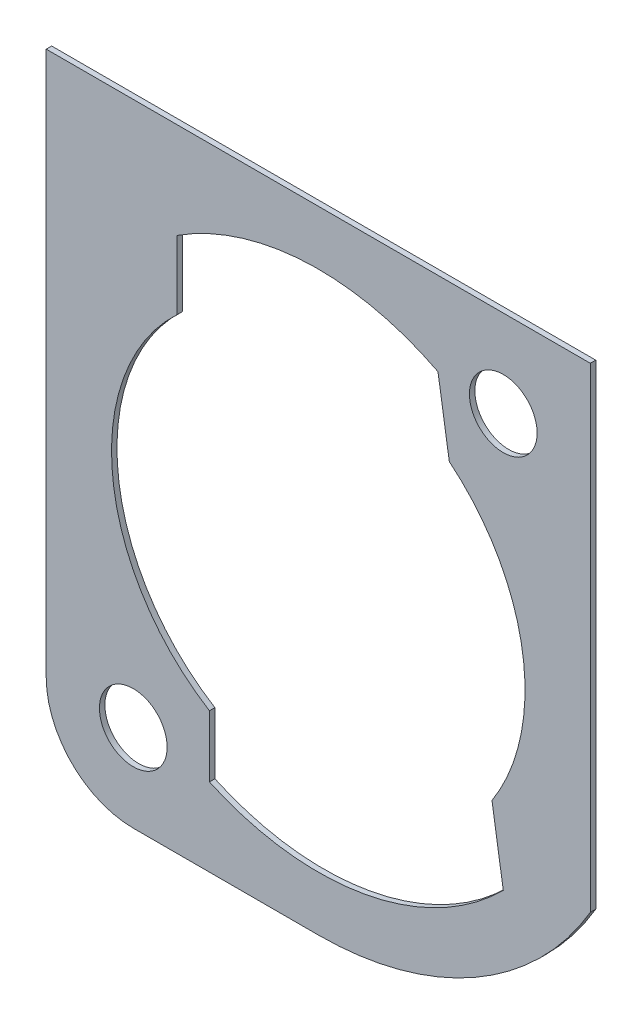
ISO-10303-21;
HEADER;
FILE_DESCRIPTION(('STEP AP214'),'2;1');
FILE_NAME('part.step','',(''),(''),'','','');
FILE_SCHEMA(('AUTOMOTIVE_DESIGN { 1 0 10303 214 1 1 1 1 }'));
ENDSEC;
DATA;
#1=APPLICATION_CONTEXT('core data for automotive mechanical design processes');
#2=APPLICATION_PROTOCOL_DEFINITION('international standard','automotive_design',2000,#1);
#3=PRODUCT_CONTEXT('',#1,'mechanical');
#4=PRODUCT('Part','Part','',(#3));
#5=PRODUCT_RELATED_PRODUCT_CATEGORY('part','',(#4));
#6=PRODUCT_DEFINITION_FORMATION('','',#4);
#7=PRODUCT_DEFINITION_CONTEXT('part definition',#1,'design');
#8=PRODUCT_DEFINITION('design','',#6,#7);
#9=PRODUCT_DEFINITION_SHAPE('','',#8);
#10=(LENGTH_UNIT() NAMED_UNIT(*) SI_UNIT(.MILLI.,.METRE.));
#11=(NAMED_UNIT(*) PLANE_ANGLE_UNIT() SI_UNIT($,.RADIAN.));
#12=(NAMED_UNIT(*) SI_UNIT($,.STERADIAN.) SOLID_ANGLE_UNIT());
#13=UNCERTAINTY_MEASURE_WITH_UNIT(LENGTH_MEASURE(1.E-05),#10,'distance_accuracy_value','');
#14=(GEOMETRIC_REPRESENTATION_CONTEXT(3) GLOBAL_UNCERTAINTY_ASSIGNED_CONTEXT((#13)) GLOBAL_UNIT_ASSIGNED_CONTEXT((#10,
#11,#12)) REPRESENTATION_CONTEXT('',''));
#15=CARTESIAN_POINT('',(0.,0.,0.));
#16=DIRECTION('',(0.,0.,1.));
#17=DIRECTION('',(1.,0.,0.));
#18=AXIS2_PLACEMENT_3D('',#15,#16,#17);
#19=CARTESIAN_POINT('',(0.,0.,-0.25));
#20=DIRECTION('',(0.,0.,1.));
#21=DIRECTION('',(1.,0.,0.));
#22=AXIS2_PLACEMENT_3D('',#19,#20,#21);
#23=PLANE('',#22);
#24=DIRECTION('',(0.,1.,0.));
#25=VECTOR('',#24,1.);
#26=CARTESIAN_POINT('',(-13.,13.85640646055,-0.25));
#27=LINE('',#26,#25);
#28=CARTESIAN_POINT('',(-13.,13.8564064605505,-0.25));
#29=VERTEX_POINT('',#28);
#30=CARTESIAN_POINT('',(-13.0000000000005,20.1742410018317,-0.25));
#31=VERTEX_POINT('',#30);
#32=EDGE_CURVE('E163',#29,#31,#27,.T.);
#33=ORIENTED_EDGE('',*,*,#32,.F.);
#34=CARTESIAN_POINT('',(0.,0.,-0.25));
#35=DIRECTION('',(0.,0.,1.));
#36=DIRECTION('',(1.,0.,0.));
#37=AXIS2_PLACEMENT_3D('',#34,#35,#36);
#38=CIRCLE('',#37,19.);
#39=CARTESIAN_POINT('',(-10.0000000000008,-16.155494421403,-0.25));
#40=VERTEX_POINT('',#39);
#41=EDGE_CURVE('E170',#29,#40,#38,.T.);
#42=ORIENTED_EDGE('',*,*,#41,.T.);
#43=DIRECTION('',(0.,1.,0.));
#44=VECTOR('',#43,1.);
#45=CARTESIAN_POINT('',(-10.,-21.81742422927,-0.25));
#46=LINE('',#45,#44);
#47=CARTESIAN_POINT('',(-10.,-21.8174242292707,-0.25));
#48=VERTEX_POINT('',#47);
#49=EDGE_CURVE('E167',#48,#40,#46,.T.);
#50=ORIENTED_EDGE('',*,*,#49,.F.);
#51=CARTESIAN_POINT('',(0.,0.,-0.25));
#52=DIRECTION('',(0.,0.,1.));
#53=DIRECTION('',(1.,0.,0.));
#54=AXIS2_PLACEMENT_3D('',#51,#52,#53);
#55=CIRCLE('',#54,24.);
#56=CARTESIAN_POINT('',(16.9999999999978,-16.9410743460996,-0.25));
#57=VERTEX_POINT('',#56);
#58=EDGE_CURVE('E175',#48,#57,#55,.T.);
#59=ORIENTED_EDGE('',*,*,#58,.T.);
#60=DIRECTION('',(0.154881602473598,-0.987933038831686,0.));
#61=VECTOR('',#60,1.);
#62=CARTESIAN_POINT('',(15.96023294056,-10.30878094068,-0.25));
#63=LINE('',#62,#61);
#64=CARTESIAN_POINT('',(15.9602329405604,-10.3087809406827,-0.25));
#65=VERTEX_POINT('',#64);
#66=EDGE_CURVE('E172',#65,#57,#63,.T.);
#67=ORIENTED_EDGE('',*,*,#66,.F.);
#68=CARTESIAN_POINT('',(0.,0.,-0.25));
#69=DIRECTION('',(0.,0.,1.));
#70=DIRECTION('',(1.,0.,0.));
#71=AXIS2_PLACEMENT_3D('',#68,#69,#70);
#72=CIRCLE('',#71,19.);
#73=CARTESIAN_POINT('',(12.0397670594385,14.698435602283,-0.25));
#74=VERTEX_POINT('',#73);
#75=EDGE_CURVE('E161',#65,#74,#72,.T.);
#76=ORIENTED_EDGE('',*,*,#75,.T.);
#77=DIRECTION('',(0.154881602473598,-0.987933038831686,0.));
#78=VECTOR('',#77,1.);
#79=CARTESIAN_POINT('',(11.,21.3307290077,-0.25));
#80=LINE('',#79,#78);
#81=CARTESIAN_POINT('',(11.0000000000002,21.3307290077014,-0.25));
#82=VERTEX_POINT('',#81);
#83=EDGE_CURVE('E158',#82,#74,#80,.T.);
#84=ORIENTED_EDGE('',*,*,#83,.F.);
#85=CARTESIAN_POINT('',(0.,0.,-0.25));
#86=DIRECTION('',(0.,0.,1.));
#87=DIRECTION('',(1.,0.,0.));
#88=AXIS2_PLACEMENT_3D('',#85,#86,#87);
#89=CIRCLE('',#88,24.);
#90=EDGE_CURVE('E165',#82,#31,#89,.T.);
#91=ORIENTED_EDGE('',*,*,#90,.T.);
#92=EDGE_LOOP('',(#33,#42,#50,#59,#67,#76,#84,#91));
#93=FACE_BOUND('',#92,.T.);
#94=CARTESIAN_POINT('',(-17.,-21.,-0.25));
#95=DIRECTION('',(0.,0.,1.));
#96=DIRECTION('',(1.,0.,0.));
#97=AXIS2_PLACEMENT_3D('',#94,#95,#96);
#98=CIRCLE('',#97,3.112298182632);
#99=CARTESIAN_POINT('',(-13.887701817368,-21.,-0.25));
#100=VERTEX_POINT('',#99);
#101=EDGE_CURVE('E162',#100,#100,#98,.T.);
#102=ORIENTED_EDGE('',*,*,#101,.T.);
#103=EDGE_LOOP('',(#102));
#104=FACE_BOUND('',#103,.T.);
#105=CARTESIAN_POINT('',(17.,21.,-0.25));
#106=DIRECTION('',(0.,0.,1.));
#107=DIRECTION('',(1.,0.,0.));
#108=AXIS2_PLACEMENT_3D('',#105,#106,#107);
#109=CIRCLE('',#108,3.112298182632);
#110=CARTESIAN_POINT('',(20.112298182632,21.,-0.25));
#111=VERTEX_POINT('',#110);
#112=EDGE_CURVE('E219',#111,#111,#109,.T.);
#113=ORIENTED_EDGE('',*,*,#112,.T.);
#114=EDGE_LOOP('',(#113));
#115=FACE_BOUND('',#114,.T.);
#116=CARTESIAN_POINT('',(-17.,-21.,-0.25));
#117=DIRECTION('',(0.,0.,1.));
#118=DIRECTION('',(1.,0.,0.));
#119=AXIS2_PLACEMENT_3D('',#116,#117,#118);
#120=CIRCLE('',#119,8.);
#121=CARTESIAN_POINT('',(-25.,-21.,-0.25));
#122=VERTEX_POINT('',#121);
#123=CARTESIAN_POINT('',(-17.,-29.,-0.25));
#124=VERTEX_POINT('',#123);
#125=EDGE_CURVE('E20',#122,#124,#120,.T.);
#126=ORIENTED_EDGE('',*,*,#125,.F.);
#127=DIRECTION('',(0.,1.,0.));
#128=VECTOR('',#127,1.);
#129=CARTESIAN_POINT('',(-25.,29.,-0.25));
#130=LINE('',#129,#128);
#131=CARTESIAN_POINT('',(-25.,29.,-0.25));
#132=VERTEX_POINT('',#131);
#133=EDGE_CURVE('E110',#132,#122,#130,.F.);
#134=ORIENTED_EDGE('',*,*,#133,.F.);
#135=DIRECTION('',(1.,0.,0.));
#136=VECTOR('',#135,1.);
#137=CARTESIAN_POINT('',(25.,29.,-0.25));
#138=LINE('',#137,#136);
#139=CARTESIAN_POINT('',(25.,29.,-0.25));
#140=VERTEX_POINT('',#139);
#141=EDGE_CURVE('E119',#140,#132,#138,.F.);
#142=ORIENTED_EDGE('',*,*,#141,.F.);
#143=DIRECTION('',(0.,1.,0.));
#144=VECTOR('',#143,1.);
#145=CARTESIAN_POINT('',(25.,-14.6969384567,-0.25));
#146=LINE('',#145,#144);
#147=CARTESIAN_POINT('',(24.9999999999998,-14.6969384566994,-0.25));
#148=VERTEX_POINT('',#147);
#149=EDGE_CURVE('E155',#148,#140,#146,.T.);
#150=ORIENTED_EDGE('',*,*,#149,.F.);
#151=CARTESIAN_POINT('',(0.,0.,-0.25));
#152=DIRECTION('',(0.,0.,1.));
#153=DIRECTION('',(1.,0.,0.));
#154=AXIS2_PLACEMENT_3D('',#151,#152,#153);
#155=CIRCLE('',#154,29.);
#156=CARTESIAN_POINT('',(0.,-29.,-0.25));
#157=VERTEX_POINT('',#156);
#158=EDGE_CURVE('E221',#157,#148,#155,.T.);
#159=ORIENTED_EDGE('',*,*,#158,.F.);
#160=DIRECTION('',(1.,0.,0.));
#161=VECTOR('',#160,1.);
#162=CARTESIAN_POINT('',(-17.,-29.,-0.25));
#163=LINE('',#162,#161);
#164=EDGE_CURVE('E177',#124,#157,#163,.T.);
#165=ORIENTED_EDGE('',*,*,#164,.F.);
#166=EDGE_LOOP('',(#126,#134,#142,#150,#159,#165));
#167=FACE_BOUND('',#166,.T.);
#168=ADVANCED_FACE('F16',(#93,#104,#115,#167),#23,.F.);
#169=CARTESIAN_POINT('',(25.,-14.6969384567,-0.25));
#170=DIRECTION('',(1.,0.,0.));
#171=DIRECTION('',(0.,0.,-1.));
#172=AXIS2_PLACEMENT_3D('',#169,#170,#171);
#173=PLANE('',#172);
#174=DIRECTION('',(0.,0.,1.));
#175=VECTOR('',#174,1.);
#176=CARTESIAN_POINT('',(24.9999999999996,-14.6969384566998,-0.25));
#177=LINE('',#176,#175);
#178=CARTESIAN_POINT('',(24.9999999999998,-14.6969384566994,0.25));
#179=VERTEX_POINT('',#178);
#180=EDGE_CURVE('E179',#148,#179,#177,.T.);
#181=ORIENTED_EDGE('',*,*,#180,.F.);
#182=ORIENTED_EDGE('',*,*,#149,.T.);
#183=DIRECTION('',(0.,0.,1.));
#184=VECTOR('',#183,1.);
#185=CARTESIAN_POINT('',(25.,29.,-0.25));
#186=LINE('',#185,#184);
#187=CARTESIAN_POINT('',(25.,29.,0.25));
#188=VERTEX_POINT('',#187);
#189=EDGE_CURVE('E124',#188,#140,#186,.F.);
#190=ORIENTED_EDGE('',*,*,#189,.F.);
#191=DIRECTION('',(0.,1.,0.));
#192=VECTOR('',#191,1.);
#193=CARTESIAN_POINT('',(25.,0.,0.25));
#194=LINE('',#193,#192);
#195=EDGE_CURVE('E145',#179,#188,#194,.T.);
#196=ORIENTED_EDGE('',*,*,#195,.F.);
#197=EDGE_LOOP('',(#181,#182,#190,#196));
#198=FACE_BOUND('',#197,.T.);
#199=ADVANCED_FACE('F404',(#198),#173,.T.);
#200=CARTESIAN_POINT('',(25.,29.,-0.25));
#201=DIRECTION('',(0.,1.,0.));
#202=DIRECTION('',(0.,0.,1.));
#203=AXIS2_PLACEMENT_3D('',#200,#201,#202);
#204=PLANE('',#203);
#205=ORIENTED_EDGE('',*,*,#189,.T.);
#206=ORIENTED_EDGE('',*,*,#141,.T.);
#207=DIRECTION('',(0.,0.,1.));
#208=VECTOR('',#207,1.);
#209=CARTESIAN_POINT('',(-25.,29.,-0.25));
#210=LINE('',#209,#208);
#211=CARTESIAN_POINT('',(-25.,29.,0.25));
#212=VERTEX_POINT('',#211);
#213=EDGE_CURVE('E126',#212,#132,#210,.F.);
#214=ORIENTED_EDGE('',*,*,#213,.F.);
#215=DIRECTION('',(1.,0.,0.));
#216=VECTOR('',#215,1.);
#217=CARTESIAN_POINT('',(0.,29.,0.25));
#218=LINE('',#217,#216);
#219=EDGE_CURVE('E130',#188,#212,#218,.F.);
#220=ORIENTED_EDGE('',*,*,#219,.F.);
#221=EDGE_LOOP('',(#205,#206,#214,#220));
#222=FACE_BOUND('',#221,.T.);
#223=ADVANCED_FACE('F128',(#222),#204,.T.);
#224=CARTESIAN_POINT('',(-25.,29.,-0.25));
#225=DIRECTION('',(-1.,0.,0.));
#226=DIRECTION('',(0.,0.,1.));
#227=AXIS2_PLACEMENT_3D('',#224,#225,#226);
#228=PLANE('',#227);
#229=ORIENTED_EDGE('',*,*,#213,.T.);
#230=ORIENTED_EDGE('',*,*,#133,.T.);
#231=DIRECTION('',(0.,0.,1.));
#232=VECTOR('',#231,1.);
#233=CARTESIAN_POINT('',(-25.,-21.,-0.25));
#234=LINE('',#233,#232);
#235=CARTESIAN_POINT('',(-25.,-21.,0.25));
#236=VERTEX_POINT('',#235);
#237=EDGE_CURVE('E137',#236,#122,#234,.F.);
#238=ORIENTED_EDGE('',*,*,#237,.F.);
#239=DIRECTION('',(0.,1.,0.));
#240=VECTOR('',#239,1.);
#241=CARTESIAN_POINT('',(-25.,0.,0.25));
#242=LINE('',#241,#240);
#243=EDGE_CURVE('E134',#212,#236,#242,.F.);
#244=ORIENTED_EDGE('',*,*,#243,.F.);
#245=EDGE_LOOP('',(#229,#230,#238,#244));
#246=FACE_BOUND('',#245,.T.);
#247=ADVANCED_FACE('F135',(#246),#228,.T.);
#248=CARTESIAN_POINT('',(-17.,-21.,-0.25));
#249=DIRECTION('',(0.,0.,1.));
#250=DIRECTION('',(1.,0.,0.));
#251=AXIS2_PLACEMENT_3D('',#248,#249,#250);
#252=CYLINDRICAL_SURFACE('',#251,8.);
#253=ORIENTED_EDGE('',*,*,#237,.T.);
#254=ORIENTED_EDGE('',*,*,#125,.T.);
#255=DIRECTION('',(0.,0.,-1.));
#256=VECTOR('',#255,1.);
#257=CARTESIAN_POINT('',(-17.,-29.,-0.25));
#258=LINE('',#257,#256);
#259=CARTESIAN_POINT('',(-17.,-29.,0.25));
#260=VERTEX_POINT('',#259);
#261=EDGE_CURVE('E180',#260,#124,#258,.T.);
#262=ORIENTED_EDGE('',*,*,#261,.F.);
#263=CARTESIAN_POINT('',(-17.,-21.,0.25));
#264=DIRECTION('',(0.,0.,1.));
#265=DIRECTION('',(1.,0.,0.));
#266=AXIS2_PLACEMENT_3D('',#263,#264,#265);
#267=CIRCLE('',#266,8.);
#268=EDGE_CURVE('E141',#236,#260,#267,.T.);
#269=ORIENTED_EDGE('',*,*,#268,.F.);
#270=EDGE_LOOP('',(#253,#254,#262,#269));
#271=FACE_BOUND('',#270,.T.);
#272=ADVANCED_FACE('F237',(#271),#252,.T.);
#273=CARTESIAN_POINT('',(-17.,-29.,-0.25));
#274=DIRECTION('',(0.,-1.,0.));
#275=DIRECTION('',(0.,0.,-1.));
#276=AXIS2_PLACEMENT_3D('',#273,#274,#275);
#277=PLANE('',#276);
#278=ORIENTED_EDGE('',*,*,#261,.T.);
#279=ORIENTED_EDGE('',*,*,#164,.T.);
#280=DIRECTION('',(0.,0.,1.));
#281=VECTOR('',#280,1.);
#282=CARTESIAN_POINT('',(0.,-29.,-0.25));
#283=LINE('',#282,#281);
#284=CARTESIAN_POINT('',(0.,-29.,0.25));
#285=VERTEX_POINT('',#284);
#286=EDGE_CURVE('E223',#285,#157,#283,.F.);
#287=ORIENTED_EDGE('',*,*,#286,.F.);
#288=DIRECTION('',(1.,0.,0.));
#289=VECTOR('',#288,1.);
#290=CARTESIAN_POINT('',(0.,-29.,0.25));
#291=LINE('',#290,#289);
#292=EDGE_CURVE('E208',#260,#285,#291,.T.);
#293=ORIENTED_EDGE('',*,*,#292,.F.);
#294=EDGE_LOOP('',(#278,#279,#287,#293));
#295=FACE_BOUND('',#294,.T.);
#296=ADVANCED_FACE('F241',(#295),#277,.T.);
#297=CARTESIAN_POINT('',(0.,0.,-0.25));
#298=DIRECTION('',(0.,0.,1.));
#299=DIRECTION('',(1.,0.,0.));
#300=AXIS2_PLACEMENT_3D('',#297,#298,#299);
#301=CYLINDRICAL_SURFACE('',#300,29.);
#302=ORIENTED_EDGE('',*,*,#286,.T.);
#303=ORIENTED_EDGE('',*,*,#158,.T.);
#304=ORIENTED_EDGE('',*,*,#180,.T.);
#305=CARTESIAN_POINT('',(0.,0.,0.25));
#306=DIRECTION('',(0.,0.,1.));
#307=DIRECTION('',(1.,0.,0.));
#308=AXIS2_PLACEMENT_3D('',#305,#306,#307);
#309=CIRCLE('',#308,29.);
#310=EDGE_CURVE('E206',#285,#179,#309,.T.);
#311=ORIENTED_EDGE('',*,*,#310,.F.);
#312=EDGE_LOOP('',(#302,#303,#304,#311));
#313=FACE_BOUND('',#312,.T.);
#314=ADVANCED_FACE('F372',(#313),#301,.T.);
#315=CARTESIAN_POINT('',(17.,21.,-0.25));
#316=DIRECTION('',(0.,0.,1.));
#317=DIRECTION('',(1.,0.,0.));
#318=AXIS2_PLACEMENT_3D('',#315,#316,#317);
#319=CYLINDRICAL_SURFACE('',#318,3.112298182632);
#320=CARTESIAN_POINT('',(17.,21.,0.25));
#321=DIRECTION('',(0.,0.,1.));
#322=DIRECTION('',(1.,0.,0.));
#323=AXIS2_PLACEMENT_3D('',#320,#321,#322);
#324=CIRCLE('',#323,3.112298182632);
#325=CARTESIAN_POINT('',(20.112298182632,21.,0.25));
#326=VERTEX_POINT('',#325);
#327=EDGE_CURVE('E203',#326,#326,#324,.F.);
#328=ORIENTED_EDGE('',*,*,#327,.F.);
#329=EDGE_LOOP('',(#328));
#330=FACE_BOUND('',#329,.T.);
#331=ORIENTED_EDGE('',*,*,#112,.F.);
#332=EDGE_LOOP('',(#331));
#333=FACE_BOUND('',#332,.T.);
#334=ADVANCED_FACE('F364',(#330,#333),#319,.F.);
#335=CARTESIAN_POINT('',(-17.,-21.,-0.25));
#336=DIRECTION('',(0.,0.,1.));
#337=DIRECTION('',(1.,0.,0.));
#338=AXIS2_PLACEMENT_3D('',#335,#336,#337);
#339=CYLINDRICAL_SURFACE('',#338,3.112298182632);
#340=CARTESIAN_POINT('',(-17.,-21.,0.25));
#341=DIRECTION('',(0.,0.,1.));
#342=DIRECTION('',(1.,0.,0.));
#343=AXIS2_PLACEMENT_3D('',#340,#341,#342);
#344=CIRCLE('',#343,3.112298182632);
#345=CARTESIAN_POINT('',(-13.887701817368,-21.,0.25));
#346=VERTEX_POINT('',#345);
#347=EDGE_CURVE('E200',#346,#346,#344,.F.);
#348=ORIENTED_EDGE('',*,*,#347,.F.);
#349=EDGE_LOOP('',(#348));
#350=FACE_BOUND('',#349,.T.);
#351=ORIENTED_EDGE('',*,*,#101,.F.);
#352=EDGE_LOOP('',(#351));
#353=FACE_BOUND('',#352,.T.);
#354=ADVANCED_FACE('F357',(#350,#353),#339,.F.);
#355=CARTESIAN_POINT('',(11.,21.3307290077,-0.25));
#356=DIRECTION('',(-0.987933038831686,-0.154881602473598,0.));
#357=DIRECTION('',(0.154881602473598,-0.987933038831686,0.));
#358=AXIS2_PLACEMENT_3D('',#355,#356,#357);
#359=PLANE('',#358);
#360=DIRECTION('',(0.,0.,1.));
#361=VECTOR('',#360,1.);
#362=CARTESIAN_POINT('',(11.0000000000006,21.3307290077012,-0.25));
#363=LINE('',#362,#361);
#364=CARTESIAN_POINT('',(11.0000000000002,21.3307290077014,0.25));
#365=VERTEX_POINT('',#364);
#366=EDGE_CURVE('E147',#365,#82,#363,.F.);
#367=ORIENTED_EDGE('',*,*,#366,.T.);
#368=ORIENTED_EDGE('',*,*,#83,.T.);
#369=DIRECTION('',(0.,0.,1.));
#370=VECTOR('',#369,1.);
#371=CARTESIAN_POINT('',(12.0397670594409,14.698435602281,-0.25));
#372=LINE('',#371,#370);
#373=CARTESIAN_POINT('',(12.0397670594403,14.6984356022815,0.25));
#374=VERTEX_POINT('',#373);
#375=EDGE_CURVE('E216',#74,#374,#372,.T.);
#376=ORIENTED_EDGE('',*,*,#375,.T.);
#377=DIRECTION('',(0.154881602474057,-0.987933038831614,0.));
#378=VECTOR('',#377,1.);
#379=CARTESIAN_POINT('',(11.,21.3307290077,0.25));
#380=LINE('',#379,#378);
#381=EDGE_CURVE('E199',#365,#374,#380,.T.);
#382=ORIENTED_EDGE('',*,*,#381,.F.);
#383=EDGE_LOOP('',(#367,#368,#376,#382));
#384=FACE_BOUND('',#383,.T.);
#385=ADVANCED_FACE('F263',(#384),#359,.T.);
#386=CARTESIAN_POINT('',(0.,0.,-0.25));
#387=DIRECTION('',(0.,0.,1.));
#388=DIRECTION('',(1.,0.,0.));
#389=AXIS2_PLACEMENT_3D('',#386,#387,#388);
#390=CYLINDRICAL_SURFACE('',#389,19.);
#391=DIRECTION('',(0.,0.,1.));
#392=VECTOR('',#391,1.);
#393=CARTESIAN_POINT('',(15.96023294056,-10.30878094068,-0.25));
#394=LINE('',#393,#392);
#395=CARTESIAN_POINT('',(15.9602329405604,-10.3087809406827,0.25));
#396=VERTEX_POINT('',#395);
#397=EDGE_CURVE('E176',#396,#65,#394,.F.);
#398=ORIENTED_EDGE('',*,*,#397,.F.);
#399=CARTESIAN_POINT('',(0.,0.,0.25));
#400=DIRECTION('',(0.,0.,1.));
#401=DIRECTION('',(1.,0.,0.));
#402=AXIS2_PLACEMENT_3D('',#399,#400,#401);
#403=CIRCLE('',#402,19.);
#404=EDGE_CURVE('E197',#374,#396,#403,.F.);
#405=ORIENTED_EDGE('',*,*,#404,.F.);
#406=ORIENTED_EDGE('',*,*,#375,.F.);
#407=ORIENTED_EDGE('',*,*,#75,.F.);
#408=EDGE_LOOP('',(#398,#405,#406,#407));
#409=FACE_BOUND('',#408,.T.);
#410=ADVANCED_FACE('F268',(#409),#390,.F.);
#411=CARTESIAN_POINT('',(15.96023294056,-10.30878094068,-0.25));
#412=DIRECTION('',(-0.987933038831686,-0.154881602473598,0.));
#413=DIRECTION('',(0.154881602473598,-0.987933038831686,0.));
#414=AXIS2_PLACEMENT_3D('',#411,#412,#413);
#415=PLANE('',#414);
#416=ORIENTED_EDGE('',*,*,#397,.T.);
#417=ORIENTED_EDGE('',*,*,#66,.T.);
#418=DIRECTION('',(0.,0.,1.));
#419=VECTOR('',#418,1.);
#420=CARTESIAN_POINT('',(16.9999999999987,-16.9410743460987,-0.25));
#421=LINE('',#420,#419);
#422=CARTESIAN_POINT('',(16.9999999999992,-16.9410743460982,0.25));
#423=VERTEX_POINT('',#422);
#424=EDGE_CURVE('E214',#57,#423,#421,.T.);
#425=ORIENTED_EDGE('',*,*,#424,.T.);
#426=DIRECTION('',(0.154881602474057,-0.987933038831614,0.));
#427=VECTOR('',#426,1.);
#428=CARTESIAN_POINT('',(15.96023294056,-10.30878094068,0.25));
#429=LINE('',#428,#427);
#430=EDGE_CURVE('E196',#396,#423,#429,.T.);
#431=ORIENTED_EDGE('',*,*,#430,.F.);
#432=EDGE_LOOP('',(#416,#417,#425,#431));
#433=FACE_BOUND('',#432,.T.);
#434=ADVANCED_FACE('F297',(#433),#415,.T.);
#435=CARTESIAN_POINT('',(0.,0.,-0.25));
#436=DIRECTION('',(0.,0.,1.));
#437=DIRECTION('',(1.,0.,0.));
#438=AXIS2_PLACEMENT_3D('',#435,#436,#437);
#439=CYLINDRICAL_SURFACE('',#438,24.);
#440=CARTESIAN_POINT('',(0.,0.,0.25));
#441=DIRECTION('',(0.,0.,1.));
#442=DIRECTION('',(1.,0.,0.));
#443=AXIS2_PLACEMENT_3D('',#440,#441,#442);
#444=CIRCLE('',#443,24.);
#445=CARTESIAN_POINT('',(-10.,-21.8174242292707,0.25));
#446=VERTEX_POINT('',#445);
#447=EDGE_CURVE('E193',#423,#446,#444,.F.);
#448=ORIENTED_EDGE('',*,*,#447,.F.);
#449=ORIENTED_EDGE('',*,*,#424,.F.);
#450=ORIENTED_EDGE('',*,*,#58,.F.);
#451=DIRECTION('',(0.,0.,-1.));
#452=VECTOR('',#451,1.);
#453=CARTESIAN_POINT('',(-10.,-21.81742422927,-0.25));
#454=LINE('',#453,#452);
#455=EDGE_CURVE('E171',#446,#48,#454,.T.);
#456=ORIENTED_EDGE('',*,*,#455,.F.);
#457=EDGE_LOOP('',(#448,#449,#450,#456));
#458=FACE_BOUND('',#457,.T.);
#459=ADVANCED_FACE('F293',(#458),#439,.F.);
#460=CARTESIAN_POINT('',(-10.,-21.81742422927,-0.25));
#461=DIRECTION('',(1.,0.,0.));
#462=DIRECTION('',(0.,0.,-1.));
#463=AXIS2_PLACEMENT_3D('',#460,#461,#462);
#464=PLANE('',#463);
#465=ORIENTED_EDGE('',*,*,#455,.T.);
#466=ORIENTED_EDGE('',*,*,#49,.T.);
#467=DIRECTION('',(0.,0.,1.));
#468=VECTOR('',#467,1.);
#469=CARTESIAN_POINT('',(-10.0000000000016,-16.1554944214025,-0.25));
#470=LINE('',#469,#468);
#471=CARTESIAN_POINT('',(-10.0000000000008,-16.155494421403,0.25));
#472=VERTEX_POINT('',#471);
#473=EDGE_CURVE('E212',#40,#472,#470,.T.);
#474=ORIENTED_EDGE('',*,*,#473,.T.);
#475=DIRECTION('',(0.,1.,0.));
#476=VECTOR('',#475,1.);
#477=CARTESIAN_POINT('',(-10.,0.,0.25));
#478=LINE('',#477,#476);
#479=EDGE_CURVE('E192',#446,#472,#478,.T.);
#480=ORIENTED_EDGE('',*,*,#479,.F.);
#481=EDGE_LOOP('',(#465,#466,#474,#480));
#482=FACE_BOUND('',#481,.T.);
#483=ADVANCED_FACE('F289',(#482),#464,.T.);
#484=CARTESIAN_POINT('',(0.,0.,-0.25));
#485=DIRECTION('',(0.,0.,1.));
#486=DIRECTION('',(1.,0.,0.));
#487=AXIS2_PLACEMENT_3D('',#484,#485,#486);
#488=CYLINDRICAL_SURFACE('',#487,19.);
#489=DIRECTION('',(0.,0.,-1.));
#490=VECTOR('',#489,1.);
#491=CARTESIAN_POINT('',(-13.,13.85640646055,-0.25));
#492=LINE('',#491,#490);
#493=CARTESIAN_POINT('',(-13.,13.8564064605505,0.25));
#494=VERTEX_POINT('',#493);
#495=EDGE_CURVE('E166',#494,#29,#492,.T.);
#496=ORIENTED_EDGE('',*,*,#495,.F.);
#497=CARTESIAN_POINT('',(0.,0.,0.25));
#498=DIRECTION('',(0.,0.,1.));
#499=DIRECTION('',(1.,0.,0.));
#500=AXIS2_PLACEMENT_3D('',#497,#498,#499);
#501=CIRCLE('',#500,19.);
#502=EDGE_CURVE('E190',#472,#494,#501,.F.);
#503=ORIENTED_EDGE('',*,*,#502,.F.);
#504=ORIENTED_EDGE('',*,*,#473,.F.);
#505=ORIENTED_EDGE('',*,*,#41,.F.);
#506=EDGE_LOOP('',(#496,#503,#504,#505));
#507=FACE_BOUND('',#506,.T.);
#508=ADVANCED_FACE('F284',(#507),#488,.F.);
#509=CARTESIAN_POINT('',(-13.,13.85640646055,-0.25));
#510=DIRECTION('',(1.,0.,0.));
#511=DIRECTION('',(0.,0.,-1.));
#512=AXIS2_PLACEMENT_3D('',#509,#510,#511);
#513=PLANE('',#512);
#514=ORIENTED_EDGE('',*,*,#495,.T.);
#515=ORIENTED_EDGE('',*,*,#32,.T.);
#516=DIRECTION('',(0.,0.,1.));
#517=VECTOR('',#516,1.);
#518=CARTESIAN_POINT('',(-13.0000000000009,20.1742410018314,-0.25));
#519=LINE('',#518,#517);
#520=CARTESIAN_POINT('',(-13.0000000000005,20.1742410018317,0.25));
#521=VERTEX_POINT('',#520);
#522=EDGE_CURVE('E35',#31,#521,#519,.T.);
#523=ORIENTED_EDGE('',*,*,#522,.T.);
#524=DIRECTION('',(0.,1.,0.));
#525=VECTOR('',#524,1.);
#526=CARTESIAN_POINT('',(-13.,0.,0.25));
#527=LINE('',#526,#525);
#528=EDGE_CURVE('E26',#494,#521,#527,.T.);
#529=ORIENTED_EDGE('',*,*,#528,.F.);
#530=EDGE_LOOP('',(#514,#515,#523,#529));
#531=FACE_BOUND('',#530,.T.);
#532=ADVANCED_FACE('F280',(#531),#513,.T.);
#533=CARTESIAN_POINT('',(0.,0.,-0.25));
#534=DIRECTION('',(0.,0.,1.));
#535=DIRECTION('',(1.,0.,0.));
#536=AXIS2_PLACEMENT_3D('',#533,#534,#535);
#537=CYLINDRICAL_SURFACE('',#536,24.);
#538=CARTESIAN_POINT('',(0.,0.,0.25));
#539=DIRECTION('',(0.,0.,1.));
#540=DIRECTION('',(1.,0.,0.));
#541=AXIS2_PLACEMENT_3D('',#538,#539,#540);
#542=CIRCLE('',#541,24.);
#543=EDGE_CURVE('E11',#521,#365,#542,.F.);
#544=ORIENTED_EDGE('',*,*,#543,.F.);
#545=ORIENTED_EDGE('',*,*,#522,.F.);
#546=ORIENTED_EDGE('',*,*,#90,.F.);
#547=ORIENTED_EDGE('',*,*,#366,.F.);
#548=EDGE_LOOP('',(#544,#545,#546,#547));
#549=FACE_BOUND('',#548,.T.);
#550=ADVANCED_FACE('F275',(#549),#537,.F.);
#551=CARTESIAN_POINT('',(0.,0.,0.25));
#552=DIRECTION('',(0.,0.,1.));
#553=DIRECTION('',(1.,0.,0.));
#554=AXIS2_PLACEMENT_3D('',#551,#552,#553);
#555=PLANE('',#554);
#556=ORIENTED_EDGE('',*,*,#528,.T.);
#557=ORIENTED_EDGE('',*,*,#543,.T.);
#558=ORIENTED_EDGE('',*,*,#381,.T.);
#559=ORIENTED_EDGE('',*,*,#404,.T.);
#560=ORIENTED_EDGE('',*,*,#430,.T.);
#561=ORIENTED_EDGE('',*,*,#447,.T.);
#562=ORIENTED_EDGE('',*,*,#479,.T.);
#563=ORIENTED_EDGE('',*,*,#502,.T.);
#564=EDGE_LOOP('',(#556,#557,#558,#559,#560,#561,#562,#563));
#565=FACE_BOUND('',#564,.T.);
#566=ORIENTED_EDGE('',*,*,#347,.T.);
#567=EDGE_LOOP('',(#566));
#568=FACE_BOUND('',#567,.T.);
#569=ORIENTED_EDGE('',*,*,#327,.T.);
#570=EDGE_LOOP('',(#569));
#571=FACE_BOUND('',#570,.T.);
#572=ORIENTED_EDGE('',*,*,#292,.T.);
#573=ORIENTED_EDGE('',*,*,#310,.T.);
#574=ORIENTED_EDGE('',*,*,#195,.T.);
#575=ORIENTED_EDGE('',*,*,#219,.T.);
#576=ORIENTED_EDGE('',*,*,#243,.T.);
#577=ORIENTED_EDGE('',*,*,#268,.T.);
#578=EDGE_LOOP('',(#572,#573,#574,#575,#576,#577));
#579=FACE_BOUND('',#578,.T.);
#580=ADVANCED_FACE('F18',(#565,#568,#571,#579),#555,.T.);
#581=CLOSED_SHELL('',(#168,#199,#223,#247,#272,#296,#314,#334,#354,#385,#410,#434,#459,#483,
#508,#532,#550,#580));
#582=MANIFOLD_SOLID_BREP('B1',#581);
#583=ADVANCED_BREP_SHAPE_REPRESENTATION('',(#18,#582),#14);
#584=SHAPE_DEFINITION_REPRESENTATION(#9,#583);
ENDSEC;
END-ISO-10303-21;
